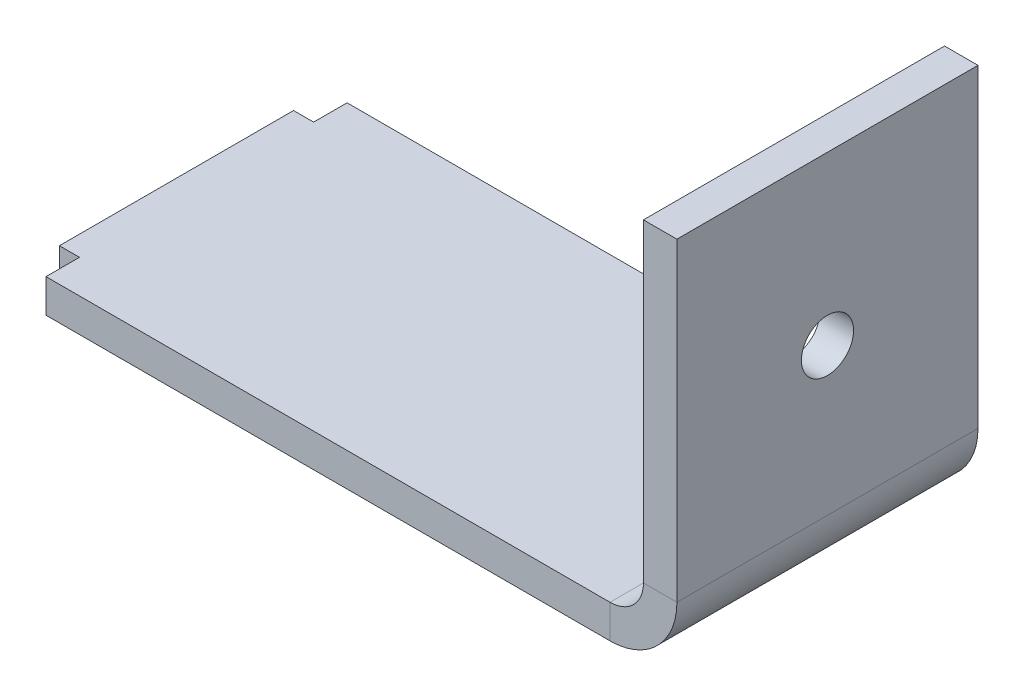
ISO-10303-21;
HEADER;
FILE_DESCRIPTION(('STEP AP214'),'2;1');
FILE_NAME('part.step','',(''),(''),'','','');
FILE_SCHEMA(('AUTOMOTIVE_DESIGN { 1 0 10303 214 1 1 1 1 }'));
ENDSEC;
DATA;
#1=APPLICATION_CONTEXT('core data for automotive mechanical design processes');
#2=APPLICATION_PROTOCOL_DEFINITION('international standard','automotive_design',2000,#1);
#3=PRODUCT_CONTEXT('',#1,'mechanical');
#4=PRODUCT('Part','Part','',(#3));
#5=PRODUCT_RELATED_PRODUCT_CATEGORY('part','',(#4));
#6=PRODUCT_DEFINITION_FORMATION('','',#4);
#7=PRODUCT_DEFINITION_CONTEXT('part definition',#1,'design');
#8=PRODUCT_DEFINITION('design','',#6,#7);
#9=PRODUCT_DEFINITION_SHAPE('','',#8);
#10=(LENGTH_UNIT() NAMED_UNIT(*) SI_UNIT(.MILLI.,.METRE.));
#11=(NAMED_UNIT(*) PLANE_ANGLE_UNIT() SI_UNIT($,.RADIAN.));
#12=(NAMED_UNIT(*) SI_UNIT($,.STERADIAN.) SOLID_ANGLE_UNIT());
#13=UNCERTAINTY_MEASURE_WITH_UNIT(LENGTH_MEASURE(1.E-05),#10,'distance_accuracy_value','');
#14=(GEOMETRIC_REPRESENTATION_CONTEXT(3) GLOBAL_UNCERTAINTY_ASSIGNED_CONTEXT((#13)) GLOBAL_UNIT_ASSIGNED_CONTEXT((#10,
#11,#12)) REPRESENTATION_CONTEXT('',''));
#15=CARTESIAN_POINT('',(0.,0.,0.));
#16=DIRECTION('',(0.,0.,1.));
#17=DIRECTION('',(1.,0.,0.));
#18=AXIS2_PLACEMENT_3D('',#15,#16,#17);
#19=CARTESIAN_POINT('',(97.3,5.,0.));
#20=DIRECTION('',(0.,0.,-1.));
#21=DIRECTION('',(-1.,0.,0.));
#22=AXIS2_PLACEMENT_3D('',#19,#20,#21);
#23=PLANE('',#22);
#24=DIRECTION('',(1.,0.,0.));
#25=VECTOR('',#24,1.);
#26=CARTESIAN_POINT('',(0.,-5.,0.));
#27=LINE('',#26,#25);
#28=CARTESIAN_POINT('',(3.,-5.,0.));
#29=VERTEX_POINT('',#28);
#30=CARTESIAN_POINT('',(87.3,-5.,0.));
#31=VERTEX_POINT('',#30);
#32=EDGE_CURVE('E321',#29,#31,#27,.T.);
#33=ORIENTED_EDGE('',*,*,#32,.F.);
#34=DIRECTION('',(0.,-1.,0.));
#35=VECTOR('',#34,1.);
#36=CARTESIAN_POINT('',(3.,0.,0.));
#37=LINE('',#36,#35);
#38=CARTESIAN_POINT('',(3.,0.,0.));
#39=VERTEX_POINT('',#38);
#40=EDGE_CURVE('E370',#39,#29,#37,.T.);
#41=ORIENTED_EDGE('',*,*,#40,.F.);
#42=DIRECTION('',(1.,0.,0.));
#43=VECTOR('',#42,1.);
#44=CARTESIAN_POINT('',(0.,0.,0.));
#45=LINE('',#44,#43);
#46=CARTESIAN_POINT('',(87.3,0.,0.));
#47=VERTEX_POINT('',#46);
#48=EDGE_CURVE('E319',#39,#47,#45,.T.);
#49=ORIENTED_EDGE('',*,*,#48,.T.);
#50=DIRECTION('',(0.,-1.,0.));
#51=VECTOR('',#50,1.);
#52=CARTESIAN_POINT('',(87.3,0.,0.));
#53=LINE('',#52,#51);
#54=EDGE_CURVE('E347',#47,#31,#53,.T.);
#55=ORIENTED_EDGE('',*,*,#54,.T.);
#56=EDGE_LOOP('',(#33,#41,#49,#55));
#57=FACE_BOUND('',#56,.T.);
#58=ADVANCED_FACE('F165',(#57),#23,.T.);
#59=CARTESIAN_POINT('',(0.,0.,45.));
#60=DIRECTION('',(0.,1.,0.));
#61=DIRECTION('',(0.,0.,1.));
#62=AXIS2_PLACEMENT_3D('',#59,#60,#61);
#63=PLANE('',#62);
#64=DIRECTION('',(-1.,0.,0.));
#65=VECTOR('',#64,1.);
#66=CARTESIAN_POINT('',(0.,0.,40.));
#67=LINE('',#66,#65);
#68=CARTESIAN_POINT('',(3.,0.,40.));
#69=VERTEX_POINT('',#68);
#70=CARTESIAN_POINT('',(0.,0.,40.));
#71=VERTEX_POINT('',#70);
#72=EDGE_CURVE('E180',#69,#71,#67,.T.);
#73=ORIENTED_EDGE('',*,*,#72,.F.);
#74=DIRECTION('',(0.,0.,-1.));
#75=VECTOR('',#74,1.);
#76=CARTESIAN_POINT('',(3.,0.,40.));
#77=LINE('',#76,#75);
#78=CARTESIAN_POINT('',(3.,0.,45.));
#79=VERTEX_POINT('',#78);
#80=EDGE_CURVE('E268',#79,#69,#77,.T.);
#81=ORIENTED_EDGE('',*,*,#80,.F.);
#82=DIRECTION('',(1.,0.,0.));
#83=VECTOR('',#82,1.);
#84=CARTESIAN_POINT('',(0.,0.,45.));
#85=LINE('',#84,#83);
#86=CARTESIAN_POINT('',(87.3,0.,45.));
#87=VERTEX_POINT('',#86);
#88=EDGE_CURVE('E255',#79,#87,#85,.T.);
#89=ORIENTED_EDGE('',*,*,#88,.T.);
#90=DIRECTION('',(0.,0.,-1.));
#91=VECTOR('',#90,1.);
#92=CARTESIAN_POINT('',(87.3,0.,45.));
#93=LINE('',#92,#91);
#94=EDGE_CURVE('E336',#87,#47,#93,.T.);
#95=ORIENTED_EDGE('',*,*,#94,.T.);
#96=ORIENTED_EDGE('',*,*,#48,.F.);
#97=DIRECTION('',(0.,0.,-1.));
#98=VECTOR('',#97,1.);
#99=CARTESIAN_POINT('',(3.,0.,5.));
#100=LINE('',#99,#98);
#101=CARTESIAN_POINT('',(3.,0.,5.));
#102=VERTEX_POINT('',#101);
#103=EDGE_CURVE('E187',#102,#39,#100,.T.);
#104=ORIENTED_EDGE('',*,*,#103,.F.);
#105=DIRECTION('',(1.,0.,0.));
#106=VECTOR('',#105,1.);
#107=CARTESIAN_POINT('',(0.,0.,5.));
#108=LINE('',#107,#106);
#109=CARTESIAN_POINT('',(0.,0.,5.00000000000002));
#110=VERTEX_POINT('',#109);
#111=EDGE_CURVE('E373',#110,#102,#108,.T.);
#112=ORIENTED_EDGE('',*,*,#111,.F.);
#113=DIRECTION('',(0.,0.,-1.));
#114=VECTOR('',#113,1.);
#115=CARTESIAN_POINT('',(0.,0.,45.));
#116=LINE('',#115,#114);
#117=EDGE_CURVE('E333',#71,#110,#116,.T.);
#118=ORIENTED_EDGE('',*,*,#117,.F.);
#119=EDGE_LOOP('',(#73,#81,#89,#95,#96,#104,#112,#118));
#120=FACE_BOUND('',#119,.T.);
#121=ADVANCED_FACE('F269',(#120),#63,.T.);
#122=CARTESIAN_POINT('',(0.,-5.,45.));
#123=DIRECTION('',(-1.,0.,0.));
#124=DIRECTION('',(0.,0.,1.));
#125=AXIS2_PLACEMENT_3D('',#122,#123,#124);
#126=PLANE('',#125);
#127=DIRECTION('',(0.,-1.,0.));
#128=VECTOR('',#127,1.);
#129=CARTESIAN_POINT('',(0.,0.,40.));
#130=LINE('',#129,#128);
#131=CARTESIAN_POINT('',(0.,-5.,40.));
#132=VERTEX_POINT('',#131);
#133=EDGE_CURVE('E281',#71,#132,#130,.T.);
#134=ORIENTED_EDGE('',*,*,#133,.F.);
#135=ORIENTED_EDGE('',*,*,#117,.T.);
#136=DIRECTION('',(0.,-1.,0.));
#137=VECTOR('',#136,1.);
#138=CARTESIAN_POINT('',(0.,0.,5.));
#139=LINE('',#138,#137);
#140=CARTESIAN_POINT('',(0.,-5.,5.00000000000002));
#141=VERTEX_POINT('',#140);
#142=EDGE_CURVE('E361',#110,#141,#139,.T.);
#143=ORIENTED_EDGE('',*,*,#142,.T.);
#144=DIRECTION('',(0.,0.,-1.));
#145=VECTOR('',#144,1.);
#146=CARTESIAN_POINT('',(0.,-5.,45.));
#147=LINE('',#146,#145);
#148=EDGE_CURVE('E330',#132,#141,#147,.T.);
#149=ORIENTED_EDGE('',*,*,#148,.F.);
#150=EDGE_LOOP('',(#134,#135,#143,#149));
#151=FACE_BOUND('',#150,.T.);
#152=ADVANCED_FACE('F381',(#151),#126,.T.);
#153=CARTESIAN_POINT('',(0.,-5.,45.));
#154=DIRECTION('',(0.,1.,0.));
#155=DIRECTION('',(0.,0.,1.));
#156=AXIS2_PLACEMENT_3D('',#153,#154,#155);
#157=PLANE('',#156);
#158=DIRECTION('',(0.,0.,1.));
#159=VECTOR('',#158,1.);
#160=CARTESIAN_POINT('',(3.,-5.,45.));
#161=LINE('',#160,#159);
#162=CARTESIAN_POINT('',(3.,-5.,40.));
#163=VERTEX_POINT('',#162);
#164=CARTESIAN_POINT('',(3.,-5.,45.));
#165=VERTEX_POINT('',#164);
#166=EDGE_CURVE('E272',#163,#165,#161,.T.);
#167=ORIENTED_EDGE('',*,*,#166,.F.);
#168=DIRECTION('',(1.,0.,0.));
#169=VECTOR('',#168,1.);
#170=CARTESIAN_POINT('',(0.,-5.,40.));
#171=LINE('',#170,#169);
#172=EDGE_CURVE('E12',#132,#163,#171,.T.);
#173=ORIENTED_EDGE('',*,*,#172,.F.);
#174=ORIENTED_EDGE('',*,*,#148,.T.);
#175=DIRECTION('',(-1.,0.,0.));
#176=VECTOR('',#175,1.);
#177=CARTESIAN_POINT('',(0.,-5.,5.));
#178=LINE('',#177,#176);
#179=CARTESIAN_POINT('',(3.,-5.,5.));
#180=VERTEX_POINT('',#179);
#181=EDGE_CURVE('E173',#180,#141,#178,.T.);
#182=ORIENTED_EDGE('',*,*,#181,.F.);
#183=DIRECTION('',(0.,0.,1.));
#184=VECTOR('',#183,1.);
#185=CARTESIAN_POINT('',(3.,-5.,45.));
#186=LINE('',#185,#184);
#187=EDGE_CURVE('E353',#29,#180,#186,.T.);
#188=ORIENTED_EDGE('',*,*,#187,.F.);
#189=ORIENTED_EDGE('',*,*,#32,.T.);
#190=DIRECTION('',(0.,0.,-1.));
#191=VECTOR('',#190,1.);
#192=CARTESIAN_POINT('',(87.3,-5.,45.));
#193=LINE('',#192,#191);
#194=CARTESIAN_POINT('',(87.3,-5.,45.));
#195=VERTEX_POINT('',#194);
#196=EDGE_CURVE('E327',#195,#31,#193,.T.);
#197=ORIENTED_EDGE('',*,*,#196,.F.);
#198=DIRECTION('',(1.,0.,0.));
#199=VECTOR('',#198,1.);
#200=CARTESIAN_POINT('',(0.,-5.,45.));
#201=LINE('',#200,#199);
#202=EDGE_CURVE('E264',#165,#195,#201,.T.);
#203=ORIENTED_EDGE('',*,*,#202,.F.);
#204=EDGE_LOOP('',(#167,#173,#174,#182,#188,#189,#197,#203));
#205=FACE_BOUND('',#204,.T.);
#206=ADVANCED_FACE('F364',(#205),#157,.F.);
#207=CARTESIAN_POINT('',(87.3,5.,45.));
#208=DIRECTION('',(0.,0.,-1.));
#209=DIRECTION('',(-1.,0.,0.));
#210=AXIS2_PLACEMENT_3D('',#207,#208,#209);
#211=PLANE('',#210);
#212=DIRECTION('',(0.,-1.,0.));
#213=VECTOR('',#212,1.);
#214=CARTESIAN_POINT('',(3.,0.,45.));
#215=LINE('',#214,#213);
#216=EDGE_CURVE('E258',#79,#165,#215,.T.);
#217=ORIENTED_EDGE('',*,*,#216,.T.);
#218=ORIENTED_EDGE('',*,*,#202,.T.);
#219=DIRECTION('',(0.,1.,0.));
#220=VECTOR('',#219,1.);
#221=CARTESIAN_POINT('',(87.3,-5.,45.));
#222=LINE('',#221,#220);
#223=EDGE_CURVE('E261',#195,#87,#222,.T.);
#224=ORIENTED_EDGE('',*,*,#223,.T.);
#225=ORIENTED_EDGE('',*,*,#88,.F.);
#226=EDGE_LOOP('',(#217,#218,#224,#225));
#227=FACE_BOUND('',#226,.T.);
#228=ADVANCED_FACE('F256',(#227),#211,.F.);
#229=CARTESIAN_POINT('',(92.3,5.,45.));
#230=DIRECTION('',(0.,0.,1.));
#231=DIRECTION('',(1.,0.,0.));
#232=AXIS2_PLACEMENT_3D('',#229,#230,#231);
#233=PLANE('',#232);
#234=DIRECTION('',(1.,0.,0.));
#235=VECTOR('',#234,1.);
#236=CARTESIAN_POINT('',(92.3,5.,45.));
#237=LINE('',#236,#235);
#238=CARTESIAN_POINT('',(92.3,5.,45.));
#239=VERTEX_POINT('',#238);
#240=CARTESIAN_POINT('',(97.3,5.,45.));
#241=VERTEX_POINT('',#240);
#242=EDGE_CURVE('E351',#239,#241,#237,.T.);
#243=ORIENTED_EDGE('',*,*,#242,.F.);
#244=CARTESIAN_POINT('',(87.3,5.,45.));
#245=DIRECTION('',(0.,0.,-1.));
#246=DIRECTION('',(-1.,0.,0.));
#247=AXIS2_PLACEMENT_3D('',#244,#245,#246);
#248=CIRCLE('',#247,5.);
#249=EDGE_CURVE('E265',#87,#239,#248,.F.);
#250=ORIENTED_EDGE('',*,*,#249,.F.);
#251=ORIENTED_EDGE('',*,*,#223,.F.);
#252=CARTESIAN_POINT('',(87.3,5.,45.));
#253=DIRECTION('',(0.,0.,1.));
#254=DIRECTION('',(1.,0.,0.));
#255=AXIS2_PLACEMENT_3D('',#252,#253,#254);
#256=CIRCLE('',#255,10.);
#257=EDGE_CURVE('E304',#195,#241,#256,.T.);
#258=ORIENTED_EDGE('',*,*,#257,.T.);
#259=EDGE_LOOP('',(#243,#250,#251,#258));
#260=FACE_BOUND('',#259,.T.);
#261=ADVANCED_FACE('F167',(#260),#233,.T.);
#262=CARTESIAN_POINT('',(87.3,-5.,45.));
#263=DIRECTION('',(0.,0.,1.));
#264=DIRECTION('',(1.,0.,0.));
#265=AXIS2_PLACEMENT_3D('',#262,#263,#264);
#266=PLANE('',#265);
#267=DIRECTION('',(0.,1.,0.));
#268=VECTOR('',#267,1.);
#269=CARTESIAN_POINT('',(92.3,0.,45.));
#270=LINE('',#269,#268);
#271=CARTESIAN_POINT('',(92.3,52.,45.));
#272=VERTEX_POINT('',#271);
#273=EDGE_CURVE('E298',#239,#272,#270,.T.);
#274=ORIENTED_EDGE('',*,*,#273,.F.);
#275=ORIENTED_EDGE('',*,*,#242,.T.);
#276=DIRECTION('',(0.,1.,0.));
#277=VECTOR('',#276,1.);
#278=CARTESIAN_POINT('',(97.3,0.,45.));
#279=LINE('',#278,#277);
#280=CARTESIAN_POINT('',(97.3,52.,45.));
#281=VERTEX_POINT('',#280);
#282=EDGE_CURVE('E292',#241,#281,#279,.T.);
#283=ORIENTED_EDGE('',*,*,#282,.T.);
#284=DIRECTION('',(1.,0.,0.));
#285=VECTOR('',#284,1.);
#286=CARTESIAN_POINT('',(92.3,52.,45.));
#287=LINE('',#286,#285);
#288=EDGE_CURVE('E294',#272,#281,#287,.T.);
#289=ORIENTED_EDGE('',*,*,#288,.F.);
#290=EDGE_LOOP('',(#274,#275,#283,#289));
#291=FACE_BOUND('',#290,.T.);
#292=ADVANCED_FACE('F400',(#291),#266,.T.);
#293=CARTESIAN_POINT('',(87.3,0.,0.));
#294=DIRECTION('',(0.,0.,-1.));
#295=DIRECTION('',(-1.,0.,0.));
#296=AXIS2_PLACEMENT_3D('',#293,#294,#295);
#297=PLANE('',#296);
#298=ORIENTED_EDGE('',*,*,#54,.F.);
#299=CARTESIAN_POINT('',(87.3,5.,0.));
#300=DIRECTION('',(0.,0.,-1.));
#301=DIRECTION('',(-1.,0.,0.));
#302=AXIS2_PLACEMENT_3D('',#299,#300,#301);
#303=CIRCLE('',#302,5.);
#304=CARTESIAN_POINT('',(92.3,5.,0.));
#305=VERTEX_POINT('',#304);
#306=EDGE_CURVE('E316',#47,#305,#303,.F.);
#307=ORIENTED_EDGE('',*,*,#306,.T.);
#308=DIRECTION('',(-1.,0.,0.));
#309=VECTOR('',#308,1.);
#310=CARTESIAN_POINT('',(97.3,5.,0.));
#311=LINE('',#310,#309);
#312=CARTESIAN_POINT('',(97.3,5.,0.));
#313=VERTEX_POINT('',#312);
#314=EDGE_CURVE('E345',#313,#305,#311,.T.);
#315=ORIENTED_EDGE('',*,*,#314,.F.);
#316=CARTESIAN_POINT('',(87.3,5.,0.));
#317=DIRECTION('',(0.,0.,1.));
#318=DIRECTION('',(1.,0.,0.));
#319=AXIS2_PLACEMENT_3D('',#316,#317,#318);
#320=CIRCLE('',#319,10.);
#321=EDGE_CURVE('E295',#31,#313,#320,.T.);
#322=ORIENTED_EDGE('',*,*,#321,.F.);
#323=EDGE_LOOP('',(#298,#307,#315,#322));
#324=FACE_BOUND('',#323,.T.);
#325=ADVANCED_FACE('F398',(#324),#297,.T.);
#326=CARTESIAN_POINT('',(97.3,0.,45.));
#327=DIRECTION('',(-1.,0.,0.));
#328=DIRECTION('',(0.,0.,1.));
#329=AXIS2_PLACEMENT_3D('',#326,#327,#328);
#330=PLANE('',#329);
#331=CARTESIAN_POINT('',(97.3,27.,22.5));
#332=DIRECTION('',(1.,0.,0.));
#333=DIRECTION('',(0.,0.,-1.));
#334=AXIS2_PLACEMENT_3D('',#331,#332,#333);
#335=CIRCLE('',#334,3.9);
#336=CARTESIAN_POINT('',(97.3,27.,18.6));
#337=VERTEX_POINT('',#336);
#338=EDGE_CURVE('E285',#337,#337,#335,.T.);
#339=ORIENTED_EDGE('',*,*,#338,.F.);
#340=EDGE_LOOP('',(#339));
#341=FACE_BOUND('',#340,.T.);
#342=DIRECTION('',(0.,1.,0.));
#343=VECTOR('',#342,1.);
#344=CARTESIAN_POINT('',(97.3,0.,0.));
#345=LINE('',#344,#343);
#346=CARTESIAN_POINT('',(97.3,52.,0.));
#347=VERTEX_POINT('',#346);
#348=EDGE_CURVE('E289',#313,#347,#345,.T.);
#349=ORIENTED_EDGE('',*,*,#348,.T.);
#350=DIRECTION('',(0.,0.,-1.));
#351=VECTOR('',#350,1.);
#352=CARTESIAN_POINT('',(97.3,52.,45.));
#353=LINE('',#352,#351);
#354=EDGE_CURVE('E343',#281,#347,#353,.T.);
#355=ORIENTED_EDGE('',*,*,#354,.F.);
#356=ORIENTED_EDGE('',*,*,#282,.F.);
#357=DIRECTION('',(0.,0.,-1.));
#358=VECTOR('',#357,1.);
#359=CARTESIAN_POINT('',(97.3,5.,45.));
#360=LINE('',#359,#358);
#361=EDGE_CURVE('E307',#241,#313,#360,.T.);
#362=ORIENTED_EDGE('',*,*,#361,.T.);
#363=EDGE_LOOP('',(#349,#355,#356,#362));
#364=FACE_BOUND('',#363,.T.);
#365=ADVANCED_FACE('F396',(#341,#364),#330,.F.);
#366=CARTESIAN_POINT('',(92.3,52.,45.));
#367=DIRECTION('',(0.,1.,0.));
#368=DIRECTION('',(0.,0.,1.));
#369=AXIS2_PLACEMENT_3D('',#366,#367,#368);
#370=PLANE('',#369);
#371=DIRECTION('',(1.,0.,0.));
#372=VECTOR('',#371,1.);
#373=CARTESIAN_POINT('',(92.3,52.,0.));
#374=LINE('',#373,#372);
#375=CARTESIAN_POINT('',(92.3,52.,0.));
#376=VERTEX_POINT('',#375);
#377=EDGE_CURVE('E310',#376,#347,#374,.T.);
#378=ORIENTED_EDGE('',*,*,#377,.F.);
#379=DIRECTION('',(0.,0.,-1.));
#380=VECTOR('',#379,1.);
#381=CARTESIAN_POINT('',(92.3,52.,45.));
#382=LINE('',#381,#380);
#383=EDGE_CURVE('E341',#272,#376,#382,.T.);
#384=ORIENTED_EDGE('',*,*,#383,.F.);
#385=ORIENTED_EDGE('',*,*,#288,.T.);
#386=ORIENTED_EDGE('',*,*,#354,.T.);
#387=EDGE_LOOP('',(#378,#384,#385,#386));
#388=FACE_BOUND('',#387,.T.);
#389=ADVANCED_FACE('F432',(#388),#370,.T.);
#390=CARTESIAN_POINT('',(92.3,0.,45.));
#391=DIRECTION('',(-1.,0.,0.));
#392=DIRECTION('',(0.,0.,1.));
#393=AXIS2_PLACEMENT_3D('',#390,#391,#392);
#394=PLANE('',#393);
#395=CARTESIAN_POINT('',(92.3,27.,22.5));
#396=DIRECTION('',(1.,0.,0.));
#397=DIRECTION('',(0.,0.,-1.));
#398=AXIS2_PLACEMENT_3D('',#395,#396,#397);
#399=CIRCLE('',#398,3.9);
#400=CARTESIAN_POINT('',(92.3,27.,18.6));
#401=VERTEX_POINT('',#400);
#402=EDGE_CURVE('E286',#401,#401,#399,.T.);
#403=ORIENTED_EDGE('',*,*,#402,.T.);
#404=EDGE_LOOP('',(#403));
#405=FACE_BOUND('',#404,.T.);
#406=DIRECTION('',(0.,1.,0.));
#407=VECTOR('',#406,1.);
#408=CARTESIAN_POINT('',(92.3,0.,0.));
#409=LINE('',#408,#407);
#410=EDGE_CURVE('E313',#305,#376,#409,.T.);
#411=ORIENTED_EDGE('',*,*,#410,.F.);
#412=DIRECTION('',(0.,0.,-1.));
#413=VECTOR('',#412,1.);
#414=CARTESIAN_POINT('',(92.3,5.,45.));
#415=LINE('',#414,#413);
#416=EDGE_CURVE('E338',#239,#305,#415,.T.);
#417=ORIENTED_EDGE('',*,*,#416,.F.);
#418=ORIENTED_EDGE('',*,*,#273,.T.);
#419=ORIENTED_EDGE('',*,*,#383,.T.);
#420=EDGE_LOOP('',(#411,#417,#418,#419));
#421=FACE_BOUND('',#420,.T.);
#422=ADVANCED_FACE('F420',(#405,#421),#394,.T.);
#423=CARTESIAN_POINT('',(87.3,5.,45.));
#424=DIRECTION('',(0.,0.,-1.));
#425=DIRECTION('',(-1.,0.,0.));
#426=AXIS2_PLACEMENT_3D('',#423,#424,#425);
#427=CYLINDRICAL_SURFACE('',#426,5.);
#428=ORIENTED_EDGE('',*,*,#306,.F.);
#429=ORIENTED_EDGE('',*,*,#94,.F.);
#430=ORIENTED_EDGE('',*,*,#249,.T.);
#431=ORIENTED_EDGE('',*,*,#416,.T.);
#432=EDGE_LOOP('',(#428,#429,#430,#431));
#433=FACE_BOUND('',#432,.T.);
#434=ADVANCED_FACE('F415',(#433),#427,.F.);
#435=CARTESIAN_POINT('',(87.3,5.,45.));
#436=DIRECTION('',(0.,0.,-1.));
#437=DIRECTION('',(-1.,0.,0.));
#438=AXIS2_PLACEMENT_3D('',#435,#436,#437);
#439=CYLINDRICAL_SURFACE('',#438,10.);
#440=ORIENTED_EDGE('',*,*,#321,.T.);
#441=ORIENTED_EDGE('',*,*,#361,.F.);
#442=ORIENTED_EDGE('',*,*,#257,.F.);
#443=ORIENTED_EDGE('',*,*,#196,.T.);
#444=EDGE_LOOP('',(#440,#441,#442,#443));
#445=FACE_BOUND('',#444,.T.);
#446=ADVANCED_FACE('F426',(#445),#439,.T.);
#447=CARTESIAN_POINT('',(87.3,5.,0.));
#448=DIRECTION('',(0.,0.,-1.));
#449=DIRECTION('',(-1.,0.,0.));
#450=AXIS2_PLACEMENT_3D('',#447,#448,#449);
#451=PLANE('',#450);
#452=ORIENTED_EDGE('',*,*,#348,.F.);
#453=ORIENTED_EDGE('',*,*,#314,.T.);
#454=ORIENTED_EDGE('',*,*,#410,.T.);
#455=ORIENTED_EDGE('',*,*,#377,.T.);
#456=EDGE_LOOP('',(#452,#453,#454,#455));
#457=FACE_BOUND('',#456,.T.);
#458=ADVANCED_FACE('F433',(#457),#451,.T.);
#459=CARTESIAN_POINT('',(92.3,27.,22.5));
#460=DIRECTION('',(1.,0.,0.));
#461=DIRECTION('',(0.,0.,-1.));
#462=AXIS2_PLACEMENT_3D('',#459,#460,#461);
#463=CYLINDRICAL_SURFACE('',#462,3.9);
#464=ORIENTED_EDGE('',*,*,#402,.F.);
#465=EDGE_LOOP('',(#464));
#466=FACE_BOUND('',#465,.T.);
#467=ORIENTED_EDGE('',*,*,#338,.T.);
#468=EDGE_LOOP('',(#467));
#469=FACE_BOUND('',#468,.T.);
#470=ADVANCED_FACE('F435',(#466,#469),#463,.F.);
#471=CARTESIAN_POINT('',(3.,0.,40.));
#472=DIRECTION('',(-1.,0.,0.));
#473=DIRECTION('',(0.,0.,1.));
#474=AXIS2_PLACEMENT_3D('',#471,#472,#473);
#475=PLANE('',#474);
#476=DIRECTION('',(0.,-1.,0.));
#477=VECTOR('',#476,1.);
#478=CARTESIAN_POINT('',(3.,0.,40.));
#479=LINE('',#478,#477);
#480=EDGE_CURVE('E277',#69,#163,#479,.T.);
#481=ORIENTED_EDGE('',*,*,#480,.T.);
#482=ORIENTED_EDGE('',*,*,#166,.T.);
#483=ORIENTED_EDGE('',*,*,#216,.F.);
#484=ORIENTED_EDGE('',*,*,#80,.T.);
#485=EDGE_LOOP('',(#481,#482,#483,#484));
#486=FACE_BOUND('',#485,.T.);
#487=ADVANCED_FACE('F275',(#486),#475,.T.);
#488=CARTESIAN_POINT('',(0.,0.,40.));
#489=DIRECTION('',(0.,0.,1.));
#490=DIRECTION('',(1.,0.,0.));
#491=AXIS2_PLACEMENT_3D('',#488,#489,#490);
#492=PLANE('',#491);
#493=ORIENTED_EDGE('',*,*,#133,.T.);
#494=ORIENTED_EDGE('',*,*,#172,.T.);
#495=ORIENTED_EDGE('',*,*,#480,.F.);
#496=ORIENTED_EDGE('',*,*,#72,.T.);
#497=EDGE_LOOP('',(#493,#494,#495,#496));
#498=FACE_BOUND('',#497,.T.);
#499=ADVANCED_FACE('F379',(#498),#492,.T.);
#500=CARTESIAN_POINT('',(0.,0.,5.));
#501=DIRECTION('',(0.,0.,-1.));
#502=DIRECTION('',(-1.,0.,0.));
#503=AXIS2_PLACEMENT_3D('',#500,#501,#502);
#504=PLANE('',#503);
#505=DIRECTION('',(0.,-1.,0.));
#506=VECTOR('',#505,1.);
#507=CARTESIAN_POINT('',(3.,0.,5.));
#508=LINE('',#507,#506);
#509=EDGE_CURVE('E362',#102,#180,#508,.T.);
#510=ORIENTED_EDGE('',*,*,#509,.T.);
#511=ORIENTED_EDGE('',*,*,#181,.T.);
#512=ORIENTED_EDGE('',*,*,#142,.F.);
#513=ORIENTED_EDGE('',*,*,#111,.T.);
#514=EDGE_LOOP('',(#510,#511,#512,#513));
#515=FACE_BOUND('',#514,.T.);
#516=ADVANCED_FACE('F359',(#515),#504,.T.);
#517=CARTESIAN_POINT('',(3.,0.,5.));
#518=DIRECTION('',(-1.,0.,0.));
#519=DIRECTION('',(0.,0.,1.));
#520=AXIS2_PLACEMENT_3D('',#517,#518,#519);
#521=PLANE('',#520);
#522=ORIENTED_EDGE('',*,*,#40,.T.);
#523=ORIENTED_EDGE('',*,*,#187,.T.);
#524=ORIENTED_EDGE('',*,*,#509,.F.);
#525=ORIENTED_EDGE('',*,*,#103,.T.);
#526=EDGE_LOOP('',(#522,#523,#524,#525));
#527=FACE_BOUND('',#526,.T.);
#528=ADVANCED_FACE('F369',(#527),#521,.T.);
#529=CLOSED_SHELL('',(#58,#121,#152,#206,#228,#261,#292,#325,#365,#389,#422,#434,#446,#458,#470,
#487,#499,#516,#528));
#530=MANIFOLD_SOLID_BREP('B2',#529);
#531=ADVANCED_BREP_SHAPE_REPRESENTATION('',(#18,#530),#14);
#532=SHAPE_DEFINITION_REPRESENTATION(#9,#531);
ENDSEC;
END-ISO-10303-21;
